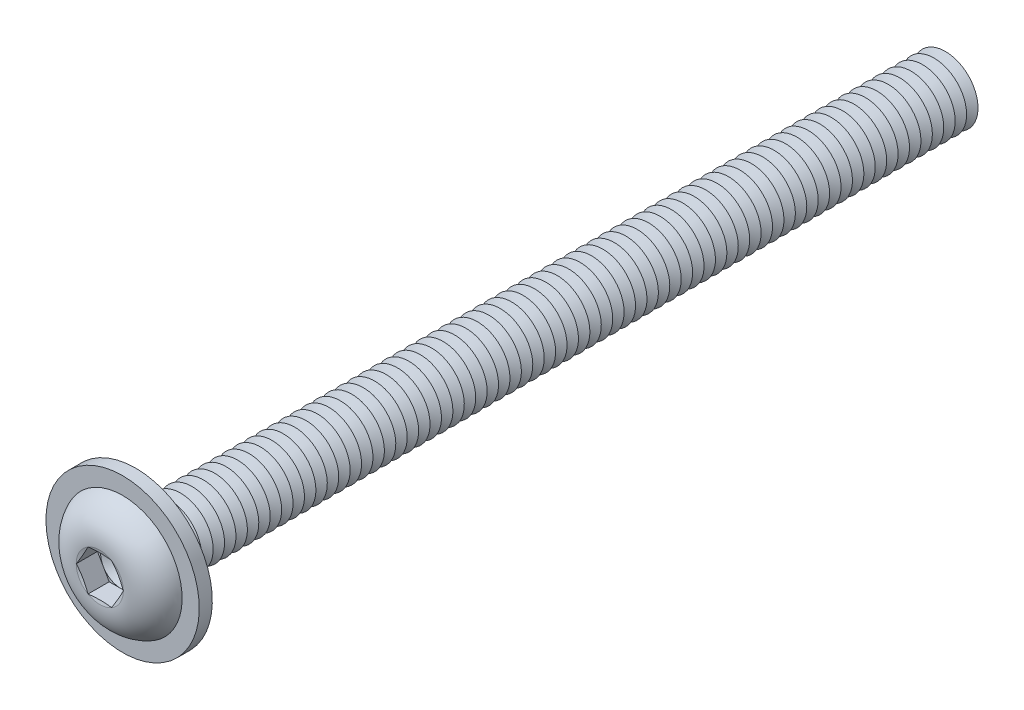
from build123d import *

# Parameters (mm, degrees)
FILLET1_R           = 0.35
LPATTERN1_COUNT     = 71
LPATTERN1_PITCH     = 0.7
CUT_EXTRUDE1_DEPTH  = 1.3
SKETCH5_R           = 4.7
SKETCH5_R_2         = 2.35
BOSS_EXTRUDE1_DEPTH = 0.8


with BuildPart() as part:
    # Sketch1 → Revolve1 (revolve)
    with BuildSketch(Plane(origin=(0, 0, 0), x_dir=(0, 0, -1), z_dir=(1, 0, 0))):
        with BuildLine():
            Line((0, 2), (0, 3.8))
            ThreePointArc((0, 3.8), (-1.611961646, 3.099623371), (-2.2, 1.443375))
            Line((-2.2, 1.443375), (-2.006624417, 0.7216875))
            Line((-2.006624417, 0.7216875), (-2.2, 0.7216875))
            Line((-2.2, 0.7216875), (-2.2, 0))
            Line((-2.2, 0), (50, 0))
            Line((50, 0), (50, 2))
            Line((50, 2), (0, 2))
        make_face()
    revolve(axis=Axis((0, 0, -50), (0, 0, 1)))

    # Fillet1
    fillet1_edges = [part.edges().sort_by_distance(p)[0] for p in [
        (0, -2, 0),
    ]]
    fillet(fillet1_edges, radius=FILLET1_R)

    # Sketch2 → Cut-Revolve1 (revolve, cut)
    with BuildSketch(Plane(origin=(0, 0, 0), x_dir=(0, 0, -1), z_dir=(1, 0, 0))):
        Polygon((49.65, 2), (50.35, 2), (50, 1.393782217), align=None)
    cut_revolve1 = revolve(axis=Axis((0, 0, -50), (0, 0, -1)), mode=Mode.SUBTRACT)

    # LPattern1: Cut-Revolve1 ×71
    with Locations(*[(0, 0, i * LPATTERN1_PITCH) for i in range(1, LPATTERN1_COUNT)]):
        add(cut_revolve1, mode=Mode.SUBTRACT)

    # Sketch3 → Cut-Extrude1 (cut)
    with BuildSketch(Plane.XY.offset(2.2)):
        Polygon((0.7216875, 1.249999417), (-0.7216875, 1.249999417), (-1.443375, 0), (-0.7216875, -1.249999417), (0.7216875, -1.249999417), (1.443375, 0), align=None)
    extrude(amount=-CUT_EXTRUDE1_DEPTH, mode=Mode.SUBTRACT)

    # Cut-Extrude2 cone 1 section (on through the dimple's axis) → Cut-Extrude2 (revolve, cut)
    with BuildSketch(Plane(origin=(0, 0, 0.9), x_dir=(0, -1, 0), z_dir=(1, 0, 0))):
        Polygon((0, 0), (1.249999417, 0), (0, 0.7216875), align=None)
    revolve(axis=Axis((0, 0, 0.9), (0, 0, -1)), mode=Mode.SUBTRACT)

    # Sketch5 → Boss-Extrude1 (add)
    with BuildSketch(Plane(origin=(0, 0, 0), x_dir=(-1, 0, 0), z_dir=(0, 0, -1))):
        with Locations(Location((0, 0, 0), (0, 0, 90))):
            Circle(SKETCH5_R)
        Circle(SKETCH5_R_2, mode=Mode.SUBTRACT)
    extrude(amount=-BOSS_EXTRUDE1_DEPTH)


solid = part.part
